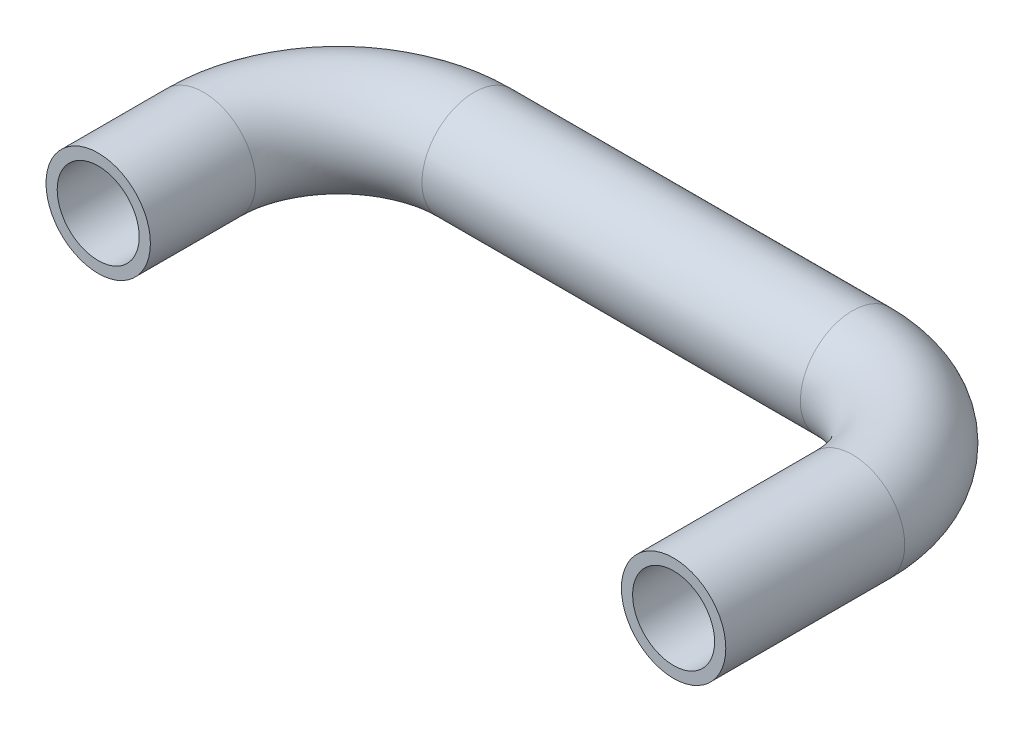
from build123d import *

# Parameters (mm, degrees)
SKETCH2_R   = 14
SKETCH2_R_2 = 11


with BuildPart() as part:
    # Sweep-Thin1: sweep along a path in Sketch1
    with BuildLine(Plane(origin=(0, 0, 0), x_dir=(1, 0, 0), z_dir=(0, 1, 0))) as sweep_thin1_path:
        Line((0, 0), (0, 28.25))
        ThreePointArc((0, 28.25), (10.632023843, 53.917976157), (36.3, 64.55))
        Line((36.3, 64.55), (137.8, 64.55))
        ThreePointArc((137.8, 64.55), (161.452721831, 54.752721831), (171.25, 31.1))
        Line((171.25, 31.1), (171.25, -16.9))
    # Sketch2 → Sweep-Thin1 (sweep)
    with BuildSketch(Plane.XY):
        Circle(SKETCH2_R)
        Circle(SKETCH2_R_2, mode=Mode.SUBTRACT)
    sweep(path=sweep_thin1_path.line)


solid = part.part
